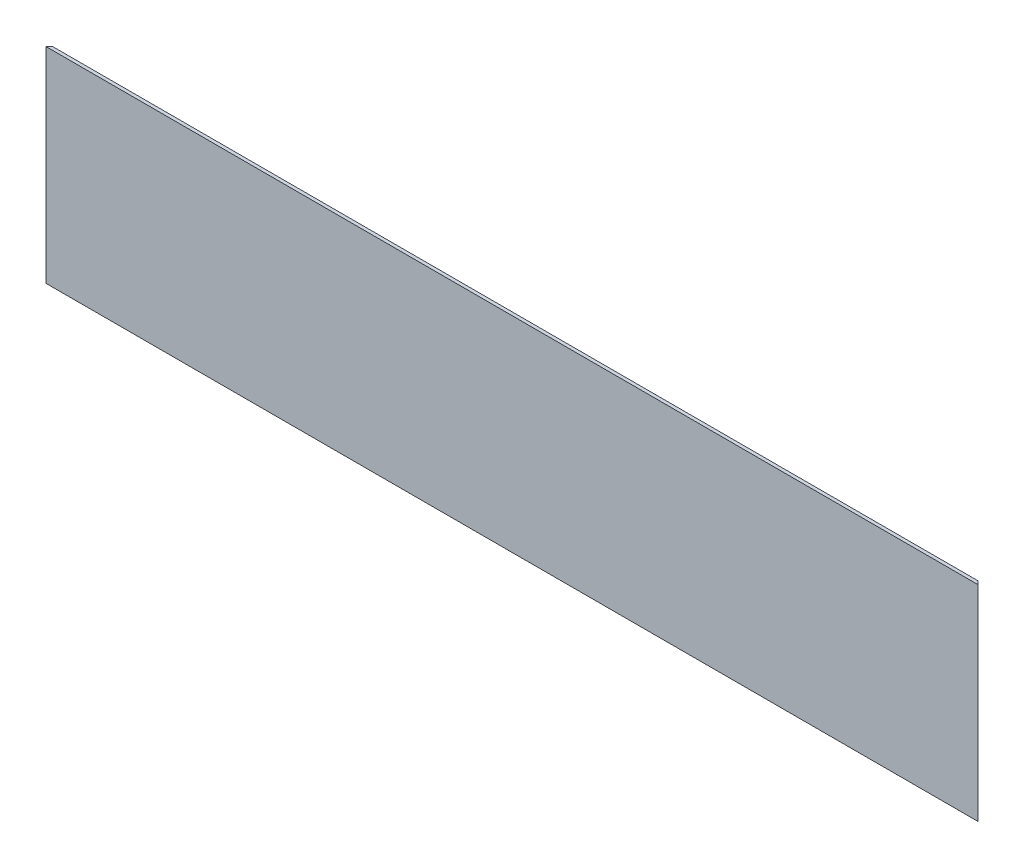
ISO-10303-21;
HEADER;
FILE_DESCRIPTION(('STEP AP214'),'2;1');
FILE_NAME('part.step','',(''),(''),'','','');
FILE_SCHEMA(('AUTOMOTIVE_DESIGN { 1 0 10303 214 1 1 1 1 }'));
ENDSEC;
DATA;
#1=APPLICATION_CONTEXT('core data for automotive mechanical design processes');
#2=APPLICATION_PROTOCOL_DEFINITION('international standard','automotive_design',2000,#1);
#3=PRODUCT_CONTEXT('',#1,'mechanical');
#4=PRODUCT('Part','Part','',(#3));
#5=PRODUCT_RELATED_PRODUCT_CATEGORY('part','',(#4));
#6=PRODUCT_DEFINITION_FORMATION('','',#4);
#7=PRODUCT_DEFINITION_CONTEXT('part definition',#1,'design');
#8=PRODUCT_DEFINITION('design','',#6,#7);
#9=PRODUCT_DEFINITION_SHAPE('','',#8);
#10=(LENGTH_UNIT() NAMED_UNIT(*) SI_UNIT(.MILLI.,.METRE.));
#11=(NAMED_UNIT(*) PLANE_ANGLE_UNIT() SI_UNIT($,.RADIAN.));
#12=(NAMED_UNIT(*) SI_UNIT($,.STERADIAN.) SOLID_ANGLE_UNIT());
#13=UNCERTAINTY_MEASURE_WITH_UNIT(LENGTH_MEASURE(1.E-05),#10,'distance_accuracy_value','');
#14=(GEOMETRIC_REPRESENTATION_CONTEXT(3) GLOBAL_UNCERTAINTY_ASSIGNED_CONTEXT((#13)) GLOBAL_UNIT_ASSIGNED_CONTEXT((#10,
#11,#12)) REPRESENTATION_CONTEXT('',''));
#15=CARTESIAN_POINT('',(0.,0.,0.));
#16=DIRECTION('',(0.,0.,1.));
#17=DIRECTION('',(1.,0.,0.));
#18=AXIS2_PLACEMENT_3D('',#15,#16,#17);
#19=CARTESIAN_POINT('',(-838.,185.0772745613,13.));
#20=DIRECTION('',(-0.707106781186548,0.,-0.707106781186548));
#21=DIRECTION('',(-0.707106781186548,0.,0.707106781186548));
#22=AXIS2_PLACEMENT_3D('',#19,#20,#21);
#23=PLANE('',#22);
#24=DIRECTION('',(0.,1.,0.));
#25=VECTOR('',#24,1.);
#26=CARTESIAN_POINT('',(-835.,0.,10.));
#27=LINE('',#26,#25);
#28=CARTESIAN_POINT('',(-835.,0.,10.));
#29=VERTEX_POINT('',#28);
#30=CARTESIAN_POINT('',(-835.,370.15454912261,10.));
#31=VERTEX_POINT('',#30);
#32=EDGE_CURVE('E86',#29,#31,#27,.T.);
#33=ORIENTED_EDGE('',*,*,#32,.F.);
#34=DIRECTION('',(0.707106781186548,0.,-0.707106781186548));
#35=VECTOR('',#34,1.);
#36=CARTESIAN_POINT('',(-841.,0.,16.));
#37=LINE('',#36,#35);
#38=CARTESIAN_POINT('',(-841.,0.,16.));
#39=VERTEX_POINT('',#38);
#40=EDGE_CURVE('E69',#39,#29,#37,.T.);
#41=ORIENTED_EDGE('',*,*,#40,.F.);
#42=DIRECTION('',(0.,-1.,0.));
#43=VECTOR('',#42,1.);
#44=CARTESIAN_POINT('',(-841.,370.15454912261,16.));
#45=LINE('',#44,#43);
#46=CARTESIAN_POINT('',(-841.,370.15454912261,16.));
#47=VERTEX_POINT('',#46);
#48=EDGE_CURVE('E98',#47,#39,#45,.T.);
#49=ORIENTED_EDGE('',*,*,#48,.F.);
#50=DIRECTION('',(-0.707106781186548,0.,0.707106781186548));
#51=VECTOR('',#50,1.);
#52=CARTESIAN_POINT('',(-835.,370.15454912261,10.));
#53=LINE('',#52,#51);
#54=EDGE_CURVE('E10',#31,#47,#53,.T.);
#55=ORIENTED_EDGE('',*,*,#54,.F.);
#56=EDGE_LOOP('',(#33,#41,#49,#55));
#57=FACE_BOUND('',#56,.T.);
#58=ADVANCED_FACE('F16',(#57),#23,.T.);
#59=CARTESIAN_POINT('',(0.,370.15454912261,13.01068575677));
#60=DIRECTION('',(0.,1.,0.));
#61=DIRECTION('',(1.,0.,0.));
#62=AXIS2_PLACEMENT_3D('',#59,#60,#61);
#63=PLANE('',#62);
#64=DIRECTION('',(1.,0.,0.));
#65=VECTOR('',#64,1.);
#66=CARTESIAN_POINT('',(-835.,370.15454912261,10.));
#67=LINE('',#66,#65);
#68=CARTESIAN_POINT('',(835.,370.15454912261,10.));
#69=VERTEX_POINT('',#68);
#70=EDGE_CURVE('E92',#31,#69,#67,.T.);
#71=ORIENTED_EDGE('',*,*,#70,.F.);
#72=ORIENTED_EDGE('',*,*,#54,.T.);
#73=DIRECTION('',(-1.,0.,0.));
#74=VECTOR('',#73,1.);
#75=CARTESIAN_POINT('',(841.,370.15454912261,16.));
#76=LINE('',#75,#74);
#77=CARTESIAN_POINT('',(841.,370.15454912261,16.));
#78=VERTEX_POINT('',#77);
#79=EDGE_CURVE('E101',#78,#47,#76,.T.);
#80=ORIENTED_EDGE('',*,*,#79,.F.);
#81=DIRECTION('',(0.707106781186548,0.,0.707106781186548));
#82=VECTOR('',#81,1.);
#83=CARTESIAN_POINT('',(835.,370.15454912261,10.));
#84=LINE('',#83,#82);
#85=EDGE_CURVE('E25',#69,#78,#84,.T.);
#86=ORIENTED_EDGE('',*,*,#85,.F.);
#87=EDGE_LOOP('',(#71,#72,#80,#86));
#88=FACE_BOUND('',#87,.T.);
#89=ADVANCED_FACE('F18',(#88),#63,.T.);
#90=CARTESIAN_POINT('',(838.,185.0772745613,13.));
#91=DIRECTION('',(0.707106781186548,0.,-0.707106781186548));
#92=DIRECTION('',(0.,-1.,0.));
#93=AXIS2_PLACEMENT_3D('',#90,#91,#92);
#94=PLANE('',#93);
#95=DIRECTION('',(0.,-1.,0.));
#96=VECTOR('',#95,1.);
#97=CARTESIAN_POINT('',(835.,370.15454912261,10.));
#98=LINE('',#97,#96);
#99=CARTESIAN_POINT('',(835.,0.,10.));
#100=VERTEX_POINT('',#99);
#101=EDGE_CURVE('E87',#69,#100,#98,.T.);
#102=ORIENTED_EDGE('',*,*,#101,.F.);
#103=ORIENTED_EDGE('',*,*,#85,.T.);
#104=DIRECTION('',(0.,1.,0.));
#105=VECTOR('',#104,1.);
#106=CARTESIAN_POINT('',(841.,0.,16.));
#107=LINE('',#106,#105);
#108=CARTESIAN_POINT('',(841.,0.,16.));
#109=VERTEX_POINT('',#108);
#110=EDGE_CURVE('E80',#109,#78,#107,.T.);
#111=ORIENTED_EDGE('',*,*,#110,.F.);
#112=DIRECTION('',(0.707106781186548,0.,0.707106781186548));
#113=VECTOR('',#112,1.);
#114=CARTESIAN_POINT('',(835.,0.,10.));
#115=LINE('',#114,#113);
#116=EDGE_CURVE('E89',#100,#109,#115,.T.);
#117=ORIENTED_EDGE('',*,*,#116,.F.);
#118=EDGE_LOOP('',(#102,#103,#111,#117));
#119=FACE_BOUND('',#118,.T.);
#120=ADVANCED_FACE('F140',(#119),#94,.T.);
#121=CARTESIAN_POINT('',(0.,185.0772745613,16.));
#122=DIRECTION('',(0.,0.,1.));
#123=DIRECTION('',(1.,0.,0.));
#124=AXIS2_PLACEMENT_3D('',#121,#122,#123);
#125=PLANE('',#124);
#126=DIRECTION('',(1.,0.,0.));
#127=VECTOR('',#126,1.);
#128=CARTESIAN_POINT('',(-841.,0.,16.));
#129=LINE('',#128,#127);
#130=EDGE_CURVE('E76',#39,#109,#129,.T.);
#131=ORIENTED_EDGE('',*,*,#130,.T.);
#132=ORIENTED_EDGE('',*,*,#110,.T.);
#133=ORIENTED_EDGE('',*,*,#79,.T.);
#134=ORIENTED_EDGE('',*,*,#48,.T.);
#135=EDGE_LOOP('',(#131,#132,#133,#134));
#136=FACE_BOUND('',#135,.T.);
#137=ADVANCED_FACE('F132',(#136),#125,.T.);
#138=CARTESIAN_POINT('',(0.,0.,13.01068575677));
#139=DIRECTION('',(0.,-1.,0.));
#140=DIRECTION('',(0.,0.,-1.));
#141=AXIS2_PLACEMENT_3D('',#138,#139,#140);
#142=PLANE('',#141);
#143=DIRECTION('',(-1.,0.,0.));
#144=VECTOR('',#143,1.);
#145=CARTESIAN_POINT('',(835.,0.,10.));
#146=LINE('',#145,#144);
#147=EDGE_CURVE('E73',#100,#29,#146,.T.);
#148=ORIENTED_EDGE('',*,*,#147,.F.);
#149=ORIENTED_EDGE('',*,*,#116,.T.);
#150=ORIENTED_EDGE('',*,*,#130,.F.);
#151=ORIENTED_EDGE('',*,*,#40,.T.);
#152=EDGE_LOOP('',(#148,#149,#150,#151));
#153=FACE_BOUND('',#152,.T.);
#154=ADVANCED_FACE('F71',(#153),#142,.T.);
#155=CARTESIAN_POINT('',(0.,185.0772745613,10.));
#156=DIRECTION('',(0.,0.,-1.));
#157=DIRECTION('',(0.,-1.,0.));
#158=AXIS2_PLACEMENT_3D('',#155,#156,#157);
#159=PLANE('',#158);
#160=ORIENTED_EDGE('',*,*,#32,.T.);
#161=ORIENTED_EDGE('',*,*,#70,.T.);
#162=ORIENTED_EDGE('',*,*,#101,.T.);
#163=ORIENTED_EDGE('',*,*,#147,.T.);
#164=EDGE_LOOP('',(#160,#161,#162,#163));
#165=FACE_BOUND('',#164,.T.);
#166=ADVANCED_FACE('F84',(#165),#159,.T.);
#167=CLOSED_SHELL('',(#58,#89,#120,#137,#154,#166));
#168=MANIFOLD_SOLID_BREP('B1',#167);
#169=ADVANCED_BREP_SHAPE_REPRESENTATION('',(#18,#168),#14);
#170=SHAPE_DEFINITION_REPRESENTATION(#9,#169);
ENDSEC;
END-ISO-10303-21;
